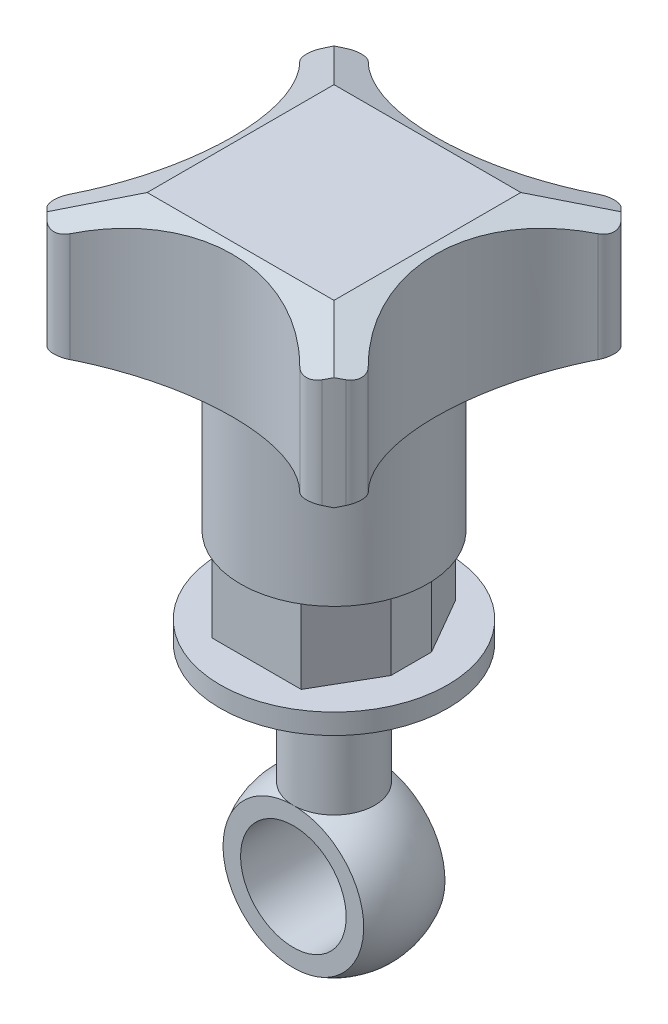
from build123d import *

# Parameters (mm, degrees)
EXTRUSION1_DEPTH        = 100
ESQUISSE2_R             = 6
EXTRUSION2_DEPTH        = 200
ESQUISSE4_OUTSIDE_W     = 116.682
ESQUISSE4_OUTSIDE_H     = 95.182
ENL_V_MAT_EXTRU_2_DEPTH = 18
ESQUISSE6_OUTSIDE_W     = 109.816
ESQUISSE6_OUTSIDE_H     = 84.374
ENL_V_MAT_EXTRU_4_DEPTH = 9.5
ESQUISSE5_OUTSIDE_W     = 109.816
ESQUISSE5_OUTSIDE_H     = 84.374
ESQUISSE5_OUTSIDE_R     = 11.5
ENL_V_MAT_EXTRU_3_DEPTH = 18
ESQUISSE7_W             = 104.126332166
ESQUISSE7_H             = 198.216391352
ENL_V_MAT_EXTRU_5_DEPTH = 213.870725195
ESQUISSE8_R             = 5
EXTRUSION3_DEPTH        = 18
ESQUISSE10_W            = 5
ESQUISSE10_H            = 18.660254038
ENL_V_MAT_EXTRU_6_DEPTH = 14
ESQUISSE11_R            = 6.5
ENL_V_MAT_EXTRU_7_DEPTH = 10
ESQUISSE12_R            = 14
EXTRUSION4_DEPTH        = 2.5


with BuildPart() as part:
    # Esquisse1 → Extrusion1 (new body)
    with BuildSketch(Plane.XY):
        with BuildLine():
            Line((13.5, 197.5), (0, 193))
            Line((0, 193), (0, 184))
            Line((0, 184), (13.5, 179.5))
            Line((13.5, 179.5), (13.5, 161.5))
            Line((13.5, 161.5), (15.5, 161.5))
            Line((15.5, 161.5), (15.5, 152))
            Line((15.5, 152), (14.304996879, 152))
            ThreePointArc((14.304996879, 152), (11.548096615, 150.898189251), (10.309987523, 148.199750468))
            Line((10.309987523, 148.199750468), (6.622379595, 74.447591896))
            ThreePointArc((6.622379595, 74.447591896), (6.855776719, 72.08982092), (7.769521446, 69.903813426))
            Line((7.769521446, 69.903813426), (47.29936656, 4.633604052))
            ThreePointArc((47.29936656, 4.633604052), (50.042189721, 1.908415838), (53.742742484, 0.787862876))
            Line((53.742742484, 0.787862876), (69.5, 0))
            Line((69.5, 0), (69.5, 71))
            Line((69.5, 71), (71.5, 71))
            Line((71.5, 71), (71.5, 74))
            Line((71.5, 74), (39.5, 84))
            Line((39.5, 84), (39.5, 152))
            Line((39.5, 152), (34.5, 152))
            Line((34.5, 152), (34.5, 161.5))
            Line((34.5, 161.5), (36.5, 161.5))
            Line((36.5, 161.5), (36.5, 179.5))
            Line((36.5, 179.5), (50, 184))
            Line((50, 184), (50, 193))
            Line((50, 193), (36.5, 197.5))
            Line((36.5, 197.5), (13.5, 197.5))
        make_face()
    extrude(amount=-EXTRUSION1_DEPTH)


with BuildPart() as body_2:
    # Esquisse2 → Extrusion2 (new body)
    with BuildSketch(Plane(origin=(0, 0, 0), x_dir=(0, 0, -1), z_dir=(1, 0, 0))):
        with BuildLine():
            Line((15.5, 161.5), (13.5, 161.5))
            Line((13.5, 161.5), (13.5, 179.5))
            Line((13.5, 179.5), (0, 184))
            Line((0, 184), (0, 193))
            Line((0, 193), (13.5, 197.5))
            Line((13.5, 197.5), (36.5, 197.5))
            Line((36.5, 197.5), (50, 193))
            Line((50, 193), (50, 184))
            Line((50, 184), (36.5, 179.5))
            Line((36.5, 179.5), (36.5, 161.5))
            Line((36.5, 161.5), (34.5, 161.5))
            Line((34.5, 161.5), (34.5, 152))
            Line((34.5, 152), (38.644356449, 152))
            ThreePointArc((38.644356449, 152), (41.420339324, 150.879916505), (42.641655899, 148.146959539))
            Line((42.641655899, 148.146959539), (45, 84))
            Line((45, 84), (45, 4))
            ThreePointArc((45, 4), (43.828427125, 1.171572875), (41, 0))
            Line((41, 0), (9, 0))
            ThreePointArc((9, 0), (6.171572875, 1.171572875), (5, 4))
            Line((5, 4), (5, 84))
            Line((5, 84), (7.358344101, 148.146959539))
            ThreePointArc((7.358344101, 148.146959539), (8.579660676, 150.879916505), (11.355643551, 152))
            Line((11.355643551, 152), (15.5, 152))
            Line((15.5, 152), (15.5, 161.5))
        make_face()
        with Locations((25, 135)):
            Circle(ESQUISSE2_R, mode=Mode.SUBTRACT)
        with BuildLine():
            Line((30, 15), (30, 58))
            ThreePointArc((30, 58), (25, 63), (20, 58))
            Line((20, 58), (20, 15))
            ThreePointArc((20, 15), (25, 10), (30, 15))
        make_face(mode=Mode.SUBTRACT)
    extrude(amount=EXTRUSION2_DEPTH)


with BuildPart() as part_1:
    add(part.part)

    # Combiner1: intersect body 2
    add(body_2.part, mode=Mode.INTERSECT)

    # Esquisse4 outside → Enl_v. mat.-Extru.2 (cut)
    with BuildSketch(Plane(origin=(0, 197.5, 0), x_dir=(-1, 0, 0), z_dir=(0, 1, 0))):
        with Locations((-35.75, -25)):
            Rectangle(ESQUISSE4_OUTSIDE_W, ESQUISSE4_OUTSIDE_H)
        with BuildLine():
            ThreePointArc((-39.140914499, -6.643356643), (-40.512431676, -6.058145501), (-41.907615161, -6.584448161))
            ThreePointArc((-41.907615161, -6.584448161), (-42.67766953, -7.32233047), (-43.415551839, -8.092384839))
            ThreePointArc((-43.415551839, -8.092384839), (-43.941854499, -9.487568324), (-43.356643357, -10.859085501))
            ThreePointArc((-43.356643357, -10.859085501), (-37.5, -25), (-43.356643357, -39.140914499))
            ThreePointArc((-43.356643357, -39.140914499), (-43.941854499, -40.512431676), (-43.415551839, -41.907615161))
            ThreePointArc((-43.415551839, -41.907615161), (-42.67766953, -42.67766953), (-41.907615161, -43.415551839))
            ThreePointArc((-41.907615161, -43.415551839), (-40.512431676, -43.941854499), (-39.140914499, -43.356643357))
            ThreePointArc((-39.140914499, -43.356643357), (-25, -37.5), (-10.859085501, -43.356643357))
            ThreePointArc((-10.859085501, -43.356643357), (-9.487568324, -43.941854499), (-8.092384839, -43.415551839))
            ThreePointArc((-8.092384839, -43.415551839), (-7.32233047, -42.67766953), (-6.584448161, -41.907615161))
            ThreePointArc((-6.584448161, -41.907615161), (-6.058145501, -40.512431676), (-6.643356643, -39.140914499))
            ThreePointArc((-6.643356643, -39.140914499), (-12.5, -25), (-6.643356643, -10.859085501))
            ThreePointArc((-6.643356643, -10.859085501), (-6.058145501, -9.487568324), (-6.584448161, -8.092384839))
            ThreePointArc((-6.584448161, -8.092384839), (-7.32233047, -7.32233047), (-8.092384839, -6.584448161))
            ThreePointArc((-8.092384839, -6.584448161), (-9.487568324, -6.058145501), (-10.859085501, -6.643356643))
            ThreePointArc((-10.859085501, -6.643356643), (-25, -12.5), (-39.140914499, -6.643356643))
        make_face(mode=Mode.SUBTRACT)
    extrude(amount=-ENL_V_MAT_EXTRU_2_DEPTH, mode=Mode.SUBTRACT)

    # Esquisse6 outside → Enl_v. mat.-Extru.4 (cut)
    with BuildSketch(Plane(origin=(0, 152, 0), x_dir=(-1, 0, 0), z_dir=(0, 1, 0))):
        with Locations((-38.779, -25)):
            Rectangle(ESQUISSE6_OUTSIDE_W, ESQUISSE6_OUTSIDE_H)
        Polygon((-19.480084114, -34.504927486), (-14, -25), (-19.488621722, -15.5), (-30.460174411, -15.5), (-35.94310095, -25.009857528), (-30.457327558, -34.504927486), align=None, mode=Mode.SUBTRACT)
    extrude(amount=ENL_V_MAT_EXTRU_4_DEPTH, mode=Mode.SUBTRACT)

    # Esquisse5 outside → Enl_v. mat.-Extru.3 (cut)
    with BuildSketch(Plane.XZ.offset(-161.5)):
        with Locations((38.779, -25)):
            Rectangle(ESQUISSE5_OUTSIDE_W, ESQUISSE5_OUTSIDE_H)
        with Locations(Location((25, -25, 0), (0, 0, 270))):
            Circle(ESQUISSE5_OUTSIDE_R, mode=Mode.SUBTRACT)
    extrude(amount=-ENL_V_MAT_EXTRU_3_DEPTH, mode=Mode.SUBTRACT)

    # Esquisse7 → Enl_v. mat.-Extru.5 (cut, through all)
    with BuildSketch(Plane(origin=(71.5, 0, 0), x_dir=(0, 0, -1), z_dir=(1, 0, 0))):
        with Locations((29.483395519, 52.891804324)):
            Rectangle(ESQUISSE7_W, ESQUISSE7_H)
    extrude(amount=-ENL_V_MAT_EXTRU_5_DEPTH, mode=Mode.SUBTRACT)

    # Esquisse8 → Extrusion3 (add)
    with BuildSketch(Plane.XZ.offset(-152)):
        with Locations(Location((25, -25, 0), (0, 0, 90))):
            Circle(ESQUISSE8_R)
    extrude(amount=EXTRUSION3_DEPTH)

    # Esquisse9 → R_volution4 (revolve)
    with BuildSketch(Plane.XY.offset(-25)):
        with BuildLine():
            Line((25, 116), (25, 136))
            ThreePointArc((25, 136), (15, 126), (25, 116))
        make_face()
    revolve(axis=Axis((25, 168.930324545, -25), (0, -1, 0)))

    # Esquisse10 → Enl_v. mat.-Extru.6 (cut, symmetric)
    with BuildSketch(Plane(origin=(25, 0, 0), x_dir=(0, 0, -1), z_dir=(1, 0, 0))):
        with Locations((17.5, 125.330127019)):
            Rectangle(ESQUISSE10_W, ESQUISSE10_H)
        with Locations((32.5, 125.330127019)):
            Rectangle(ESQUISSE10_W, ESQUISSE10_H)
    extrude(amount=ENL_V_MAT_EXTRU_6_DEPTH, both=True, mode=Mode.SUBTRACT)

    # Esquisse11 → Enl_v. mat.-Extru.7 (cut)
    with BuildSketch(Plane(origin=(0, 0, -30), x_dir=(-1, 0, 0), z_dir=(0, 0, -1))):
        with Locations(Location((-25, 126, 0), (0, 0, 90))):
            Circle(ESQUISSE11_R)
    extrude(amount=-ENL_V_MAT_EXTRU_7_DEPTH, mode=Mode.SUBTRACT)

    # Esquisse12 → Extrusion4 (add)
    with BuildSketch(Plane.XZ.offset(-152)):
        with Locations(Location((25, -25, 0), (0, 0, 270))):
            Circle(ESQUISSE12_R)
    extrude(amount=EXTRUSION4_DEPTH)


solid = part_1.part
